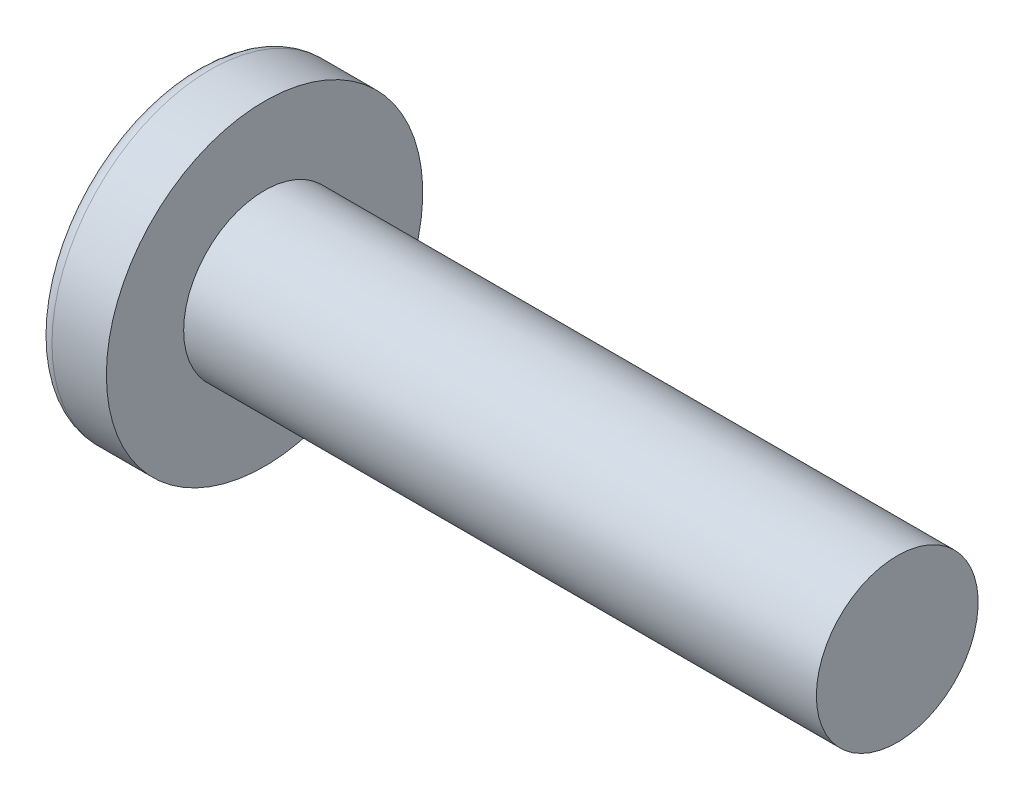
ISO-10303-21;
HEADER;
FILE_DESCRIPTION(('STEP AP214'),'2;1');
FILE_NAME('part.step','',(''),(''),'','','');
FILE_SCHEMA(('AUTOMOTIVE_DESIGN { 1 0 10303 214 1 1 1 1 }'));
ENDSEC;
DATA;
#1=APPLICATION_CONTEXT('core data for automotive mechanical design processes');
#2=APPLICATION_PROTOCOL_DEFINITION('international standard','automotive_design',2000,#1);
#3=PRODUCT_CONTEXT('',#1,'mechanical');
#4=PRODUCT('Part','Part','',(#3));
#5=PRODUCT_RELATED_PRODUCT_CATEGORY('part','',(#4));
#6=PRODUCT_DEFINITION_FORMATION('','',#4);
#7=PRODUCT_DEFINITION_CONTEXT('part definition',#1,'design');
#8=PRODUCT_DEFINITION('design','',#6,#7);
#9=PRODUCT_DEFINITION_SHAPE('','',#8);
#10=(LENGTH_UNIT() NAMED_UNIT(*) SI_UNIT(.MILLI.,.METRE.));
#11=(NAMED_UNIT(*) PLANE_ANGLE_UNIT() SI_UNIT($,.RADIAN.));
#12=(NAMED_UNIT(*) SI_UNIT($,.STERADIAN.) SOLID_ANGLE_UNIT());
#13=UNCERTAINTY_MEASURE_WITH_UNIT(LENGTH_MEASURE(1.E-05),#10,'distance_accuracy_value','');
#14=(GEOMETRIC_REPRESENTATION_CONTEXT(3) GLOBAL_UNCERTAINTY_ASSIGNED_CONTEXT((#13)) GLOBAL_UNIT_ASSIGNED_CONTEXT((#10,
#11,#12)) REPRESENTATION_CONTEXT('',''));
#15=CARTESIAN_POINT('',(0.,0.,0.));
#16=DIRECTION('',(0.,0.,1.));
#17=DIRECTION('',(1.,0.,0.));
#18=AXIS2_PLACEMENT_3D('',#15,#16,#17);
#19=CARTESIAN_POINT('',(4.55168,0.,0.));
#20=DIRECTION('',(-1.,0.,0.));
#21=DIRECTION('',(0.,1.,0.));
#22=AXIS2_PLACEMENT_3D('',#19,#20,#21);
#23=SPHERICAL_SURFACE('',#22,4.55168);
#24=CARTESIAN_POINT('',(0.870207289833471,0.,0.));
#25=DIRECTION('',(-1.,0.,0.));
#26=DIRECTION('',(0.,0.,1.));
#27=AXIS2_PLACEMENT_3D('',#24,#25,#26);
#28=CIRCLE('',#27,2.67666761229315);
#29=CARTESIAN_POINT('',(0.870207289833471,0.,2.67666761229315));
#30=VERTEX_POINT('',#29);
#31=EDGE_CURVE('E157',#30,#30,#28,.T.);
#32=ORIENTED_EDGE('',*,*,#31,.T.);
#33=EDGE_LOOP('',(#32));
#34=FACE_BOUND('',#33,.T.);
#35=CARTESIAN_POINT('',(4.54621406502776,-0.053976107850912,0.));
#36=DIRECTION('',(-0.100750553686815,-0.9949117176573,0.));
#37=DIRECTION('',(0.994911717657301,-0.100750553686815,0.));
#38=AXIS2_PLACEMENT_3D('',#35,#36,#37);
#39=CIRCLE('',#38,4.55135666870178);
#40=CARTESIAN_POINT('',(0.29828010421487,0.376194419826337,1.57634320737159));
#41=VERTEX_POINT('',#40);
#42=CARTESIAN_POINT('',(0.0357821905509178,0.402776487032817,0.402776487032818));
#43=VERTEX_POINT('',#42);
#44=EDGE_CURVE('E188',#41,#43,#39,.T.);
#45=ORIENTED_EDGE('',*,*,#44,.F.);
#46=CARTESIAN_POINT('',(3.65196023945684,0.,-1.11933639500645));
#47=DIRECTION('',(0.626498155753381,0.,0.77942290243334));
#48=DIRECTION('',(0.77942290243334,0.,-0.626498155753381));
#49=AXIS2_PLACEMENT_3D('',#46,#47,#48);
#50=CIRCLE('',#49,4.31918756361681);
#51=CARTESIAN_POINT('',(0.298280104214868,-0.376194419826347,1.57634320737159));
#52=VERTEX_POINT('',#51);
#53=EDGE_CURVE('E153',#41,#52,#50,.T.);
#54=ORIENTED_EDGE('',*,*,#53,.T.);
#55=CARTESIAN_POINT('',(4.54621406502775,0.053976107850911,0.));
#56=DIRECTION('',(-0.100750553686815,0.994911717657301,0.));
#57=DIRECTION('',(-0.994911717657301,-0.100750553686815,0.));
#58=AXIS2_PLACEMENT_3D('',#55,#56,#57);
#59=CIRCLE('',#58,4.55135666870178);
#60=CARTESIAN_POINT('',(0.0357821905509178,-0.402776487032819,0.402776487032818));
#61=VERTEX_POINT('',#60);
#62=EDGE_CURVE('E109',#61,#52,#59,.T.);
#63=ORIENTED_EDGE('',*,*,#62,.F.);
#64=CARTESIAN_POINT('',(4.54621406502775,0.,-0.0539761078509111));
#65=DIRECTION('',(-0.100750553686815,0.,-0.994911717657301));
#66=DIRECTION('',(-0.994911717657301,0.,0.100750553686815));
#67=AXIS2_PLACEMENT_3D('',#64,#65,#66);
#68=CIRCLE('',#67,4.55135666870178);
#69=CARTESIAN_POINT('',(0.298280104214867,-1.57634320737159,0.376194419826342));
#70=VERTEX_POINT('',#69);
#71=EDGE_CURVE('E134',#70,#61,#68,.T.);
#72=ORIENTED_EDGE('',*,*,#71,.F.);
#73=CARTESIAN_POINT('',(3.65196023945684,1.11933639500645,0.));
#74=DIRECTION('',(0.626498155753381,-0.77942290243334,0.));
#75=DIRECTION('',(0.77942290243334,0.626498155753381,0.));
#76=AXIS2_PLACEMENT_3D('',#73,#74,#75);
#77=CIRCLE('',#76,4.31918756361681);
#78=CARTESIAN_POINT('',(0.298280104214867,-1.57634320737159,-0.376194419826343));
#79=VERTEX_POINT('',#78);
#80=EDGE_CURVE('E142',#70,#79,#77,.T.);
#81=ORIENTED_EDGE('',*,*,#80,.T.);
#82=CARTESIAN_POINT('',(4.54621406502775,0.,0.053976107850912));
#83=DIRECTION('',(-0.100750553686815,0.,0.9949117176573));
#84=DIRECTION('',(0.994911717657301,0.,0.100750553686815));
#85=AXIS2_PLACEMENT_3D('',#82,#83,#84);
#86=CIRCLE('',#85,4.55135666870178);
#87=CARTESIAN_POINT('',(0.0357821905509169,-0.402776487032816,-0.402776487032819));
#88=VERTEX_POINT('',#87);
#89=EDGE_CURVE('E52',#88,#79,#86,.T.);
#90=ORIENTED_EDGE('',*,*,#89,.F.);
#91=CARTESIAN_POINT('',(0.298280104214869,-0.376194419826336,-1.57634320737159));
#92=VERTEX_POINT('',#91);
#93=EDGE_CURVE('E195',#92,#88,#59,.T.);
#94=ORIENTED_EDGE('',*,*,#93,.F.);
#95=CARTESIAN_POINT('',(3.65196023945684,0.,1.11933639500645));
#96=DIRECTION('',(0.626498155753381,0.,-0.77942290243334));
#97=DIRECTION('',(-0.77942290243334,0.,-0.626498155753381));
#98=AXIS2_PLACEMENT_3D('',#95,#96,#97);
#99=CIRCLE('',#98,4.31918756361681);
#100=CARTESIAN_POINT('',(0.29828010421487,0.376194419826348,-1.57634320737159));
#101=VERTEX_POINT('',#100);
#102=EDGE_CURVE('E135',#92,#101,#99,.T.);
#103=ORIENTED_EDGE('',*,*,#102,.T.);
#104=CARTESIAN_POINT('',(0.0357821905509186,0.40277648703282,-0.402776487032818));
#105=VERTEX_POINT('',#104);
#106=EDGE_CURVE('E183',#105,#101,#39,.T.);
#107=ORIENTED_EDGE('',*,*,#106,.F.);
#108=CARTESIAN_POINT('',(0.29828010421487,1.57634320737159,-0.376194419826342));
#109=VERTEX_POINT('',#108);
#110=EDGE_CURVE('E45',#109,#105,#86,.T.);
#111=ORIENTED_EDGE('',*,*,#110,.F.);
#112=CARTESIAN_POINT('',(3.65196023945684,-1.11933639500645,0.));
#113=DIRECTION('',(0.626498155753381,0.77942290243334,0.));
#114=DIRECTION('',(-0.77942290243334,0.626498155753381,0.));
#115=AXIS2_PLACEMENT_3D('',#112,#113,#114);
#116=CIRCLE('',#115,4.31918756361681);
#117=CARTESIAN_POINT('',(0.29828010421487,1.57634320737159,0.376194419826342));
#118=VERTEX_POINT('',#117);
#119=EDGE_CURVE('E11',#109,#118,#116,.T.);
#120=ORIENTED_EDGE('',*,*,#119,.T.);
#121=EDGE_CURVE('E171',#43,#118,#68,.T.);
#122=ORIENTED_EDGE('',*,*,#121,.F.);
#123=EDGE_LOOP('',(#45,#54,#63,#72,#81,#90,#94,#103,#107,#111,#120,#122));
#124=FACE_BOUND('',#123,.T.);
#125=ADVANCED_FACE('F37',(#34,#124),#23,.T.);
#126=CARTESIAN_POINT('',(2.2594,0.,-0.1776));
#127=DIRECTION('',(-0.100750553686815,0.,0.9949117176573));
#128=DIRECTION('',(0.994911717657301,0.,0.100750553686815));
#129=AXIS2_PLACEMENT_3D('',#126,#127,#128);
#130=PLANE('',#129);
#131=ORIENTED_EDGE('',*,*,#110,.T.);
#132=DIRECTION('',(0.989900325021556,-0.100243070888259,0.100243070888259));
#133=VECTOR('',#132,1.);
#134=CARTESIAN_POINT('',(2.27702336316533,0.175815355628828,-0.175815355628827));
#135=LINE('',#134,#133);
#136=CARTESIAN_POINT('',(2.0066,0.203200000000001,-0.203199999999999));
#137=VERTEX_POINT('',#136);
#138=EDGE_CURVE('E177',#105,#137,#135,.T.);
#139=ORIENTED_EDGE('',*,*,#138,.T.);
#140=DIRECTION('',(0.777006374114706,-0.624555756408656,0.0786841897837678));
#141=VECTOR('',#140,1.);
#142=CARTESIAN_POINT('',(0.,1.8161,-0.4064));
#143=LINE('',#142,#141);
#144=EDGE_CURVE('E158',#109,#137,#143,.T.);
#145=ORIENTED_EDGE('',*,*,#144,.F.);
#146=EDGE_LOOP('',(#131,#139,#145));
#147=FACE_BOUND('',#146,.T.);
#148=ADVANCED_FACE('F176',(#147),#130,.T.);
#149=DIRECTION('',(0.777006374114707,0.624555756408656,0.0786841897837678));
#150=VECTOR('',#149,1.);
#151=CARTESIAN_POINT('',(0.,-1.8161,-0.4064));
#152=LINE('',#151,#150);
#153=CARTESIAN_POINT('',(2.0066,-0.2032,-0.2032));
#154=VERTEX_POINT('',#153);
#155=EDGE_CURVE('E143',#79,#154,#152,.T.);
#156=ORIENTED_EDGE('',*,*,#155,.T.);
#157=DIRECTION('',(-0.989900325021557,-0.100243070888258,-0.100243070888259));
#158=VECTOR('',#157,1.);
#159=CARTESIAN_POINT('',(2.27702336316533,-0.175815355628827,-0.175815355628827));
#160=LINE('',#159,#158);
#161=EDGE_CURVE('E198',#154,#88,#160,.T.);
#162=ORIENTED_EDGE('',*,*,#161,.T.);
#163=ORIENTED_EDGE('',*,*,#89,.T.);
#164=EDGE_LOOP('',(#156,#162,#163));
#165=FACE_BOUND('',#164,.T.);
#166=ADVANCED_FACE('F213',(#165),#130,.T.);
#167=CARTESIAN_POINT('',(2.2594,0.,0.1776));
#168=DIRECTION('',(-0.100750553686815,0.,-0.994911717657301));
#169=DIRECTION('',(-0.994911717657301,0.,0.100750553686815));
#170=AXIS2_PLACEMENT_3D('',#167,#168,#169);
#171=PLANE('',#170);
#172=DIRECTION('',(0.777006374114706,-0.624555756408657,-0.0786841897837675));
#173=VECTOR('',#172,1.);
#174=CARTESIAN_POINT('',(0.,1.8161,0.406399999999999));
#175=LINE('',#174,#173);
#176=CARTESIAN_POINT('',(2.0066,0.2032,0.2032));
#177=VERTEX_POINT('',#176);
#178=EDGE_CURVE('E214',#118,#177,#175,.T.);
#179=ORIENTED_EDGE('',*,*,#178,.T.);
#180=DIRECTION('',(-0.989900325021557,0.100243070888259,0.100243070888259));
#181=VECTOR('',#180,1.);
#182=CARTESIAN_POINT('',(2.27702336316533,0.175815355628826,0.175815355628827));
#183=LINE('',#182,#181);
#184=EDGE_CURVE('E192',#177,#43,#183,.T.);
#185=ORIENTED_EDGE('',*,*,#184,.T.);
#186=ORIENTED_EDGE('',*,*,#121,.T.);
#187=EDGE_LOOP('',(#179,#185,#186));
#188=FACE_BOUND('',#187,.T.);
#189=ADVANCED_FACE('F218',(#188),#171,.T.);
#190=ORIENTED_EDGE('',*,*,#71,.T.);
#191=DIRECTION('',(0.989900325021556,0.100243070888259,-0.100243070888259));
#192=VECTOR('',#191,1.);
#193=CARTESIAN_POINT('',(2.27702336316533,-0.175815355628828,0.175815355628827));
#194=LINE('',#193,#192);
#195=CARTESIAN_POINT('',(2.0066,-0.203200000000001,0.203199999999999));
#196=VERTEX_POINT('',#195);
#197=EDGE_CURVE('E107',#61,#196,#194,.T.);
#198=ORIENTED_EDGE('',*,*,#197,.T.);
#199=DIRECTION('',(0.777006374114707,0.624555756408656,-0.0786841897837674));
#200=VECTOR('',#199,1.);
#201=CARTESIAN_POINT('',(0.,-1.8161,0.406399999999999));
#202=LINE('',#201,#200);
#203=EDGE_CURVE('E132',#70,#196,#202,.T.);
#204=ORIENTED_EDGE('',*,*,#203,.F.);
#205=EDGE_LOOP('',(#190,#198,#204));
#206=FACE_BOUND('',#205,.T.);
#207=ADVANCED_FACE('F131',(#206),#171,.T.);
#208=CARTESIAN_POINT('',(-25.4,0.,0.));
#209=DIRECTION('',(-1.,0.,0.));
#210=DIRECTION('',(0.,0.,1.));
#211=AXIS2_PLACEMENT_3D('',#208,#209,#210);
#212=CYLINDRICAL_SURFACE('',#211,1.4224);
#213=CARTESIAN_POINT('',(13.1572,0.,0.));
#214=DIRECTION('',(-1.,0.,0.));
#215=DIRECTION('',(0.,0.,1.));
#216=AXIS2_PLACEMENT_3D('',#213,#214,#215);
#217=CIRCLE('',#216,1.4224);
#218=CARTESIAN_POINT('',(13.1572,0.,1.4224));
#219=VERTEX_POINT('',#218);
#220=EDGE_CURVE('E154',#219,#219,#217,.T.);
#221=ORIENTED_EDGE('',*,*,#220,.T.);
#222=EDGE_LOOP('',(#221));
#223=FACE_BOUND('',#222,.T.);
#224=CARTESIAN_POINT('',(2.032,0.,0.));
#225=DIRECTION('',(-1.,0.,0.));
#226=DIRECTION('',(0.,0.,1.));
#227=AXIS2_PLACEMENT_3D('',#224,#225,#226);
#228=CIRCLE('',#227,1.4224);
#229=CARTESIAN_POINT('',(2.032,0.,1.4224));
#230=VERTEX_POINT('',#229);
#231=EDGE_CURVE('E167',#230,#230,#228,.T.);
#232=ORIENTED_EDGE('',*,*,#231,.F.);
#233=EDGE_LOOP('',(#232));
#234=FACE_BOUND('',#233,.T.);
#235=ADVANCED_FACE('F39',(#223,#234),#212,.T.);
#236=CARTESIAN_POINT('',(2.032,1.4224,0.));
#237=DIRECTION('',(-1.,0.,0.));
#238=DIRECTION('',(0.,0.,1.));
#239=AXIS2_PLACEMENT_3D('',#236,#237,#238);
#240=PLANE('',#239);
#241=CARTESIAN_POINT('',(2.032,0.,0.));
#242=DIRECTION('',(-1.,0.,0.));
#243=DIRECTION('',(0.,0.,1.));
#244=AXIS2_PLACEMENT_3D('',#241,#242,#243);
#245=CIRCLE('',#244,2.7813);
#246=CARTESIAN_POINT('',(2.032,0.,2.7813));
#247=VERTEX_POINT('',#246);
#248=EDGE_CURVE('E164',#247,#247,#245,.T.);
#249=ORIENTED_EDGE('',*,*,#248,.F.);
#250=EDGE_LOOP('',(#249));
#251=FACE_BOUND('',#250,.T.);
#252=ORIENTED_EDGE('',*,*,#231,.T.);
#253=EDGE_LOOP('',(#252));
#254=FACE_BOUND('',#253,.T.);
#255=ADVANCED_FACE('F246',(#251,#254),#240,.F.);
#256=CARTESIAN_POINT('',(-25.4,0.,0.));
#257=DIRECTION('',(-1.,0.,0.));
#258=DIRECTION('',(0.,0.,1.));
#259=AXIS2_PLACEMENT_3D('',#256,#257,#258);
#260=CYLINDRICAL_SURFACE('',#259,2.7813);
#261=ORIENTED_EDGE('',*,*,#248,.T.);
#262=EDGE_LOOP('',(#261));
#263=FACE_BOUND('',#262,.T.);
#264=CARTESIAN_POINT('',(1.07564661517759,0.,0.));
#265=DIRECTION('',(-1.,0.,0.));
#266=DIRECTION('',(0.,0.,1.));
#267=AXIS2_PLACEMENT_3D('',#264,#265,#266);
#268=CIRCLE('',#267,2.7813);
#269=CARTESIAN_POINT('',(1.07564661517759,0.,2.7813));
#270=VERTEX_POINT('',#269);
#271=EDGE_CURVE('E161',#270,#270,#268,.T.);
#272=ORIENTED_EDGE('',*,*,#271,.F.);
#273=EDGE_LOOP('',(#272));
#274=FACE_BOUND('',#273,.T.);
#275=ADVANCED_FACE('F243',(#263,#274),#260,.T.);
#276=CARTESIAN_POINT('',(1.07564661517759,0.,0.));
#277=DIRECTION('',(-1.,0.,0.));
#278=DIRECTION('',(0.,0.,1.));
#279=AXIS2_PLACEMENT_3D('',#276,#277,#278);
#280=TOROIDAL_SURFACE('',#279,2.5273,0.254);
#281=ORIENTED_EDGE('',*,*,#271,.T.);
#282=EDGE_LOOP('',(#281));
#283=FACE_BOUND('',#282,.T.);
#284=ORIENTED_EDGE('',*,*,#31,.F.);
#285=EDGE_LOOP('',(#284));
#286=FACE_BOUND('',#285,.T.);
#287=ADVANCED_FACE('F240',(#283,#286),#280,.T.);
#288=CARTESIAN_POINT('',(13.1572,1.4224,0.));
#289=DIRECTION('',(1.,0.,0.));
#290=DIRECTION('',(0.,0.,-1.));
#291=AXIS2_PLACEMENT_3D('',#288,#289,#290);
#292=PLANE('',#291);
#293=ORIENTED_EDGE('',*,*,#220,.F.);
#294=EDGE_LOOP('',(#293));
#295=FACE_BOUND('',#294,.T.);
#296=ADVANCED_FACE('F238',(#295),#292,.T.);
#297=CARTESIAN_POINT('',(2.0066,0.2032,0.2032));
#298=DIRECTION('',(0.626498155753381,0.77942290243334,0.));
#299=DIRECTION('',(-0.77942290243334,0.626498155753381,0.));
#300=AXIS2_PLACEMENT_3D('',#297,#298,#299);
#301=PLANE('',#300);
#302=ORIENTED_EDGE('',*,*,#144,.T.);
#303=DIRECTION('',(0.,0.,-1.));
#304=VECTOR('',#303,1.);
#305=CARTESIAN_POINT('',(2.0066,0.2032,0.2032));
#306=LINE('',#305,#304);
#307=EDGE_CURVE('E125',#177,#137,#306,.T.);
#308=ORIENTED_EDGE('',*,*,#307,.F.);
#309=ORIENTED_EDGE('',*,*,#178,.F.);
#310=ORIENTED_EDGE('',*,*,#119,.F.);
#311=EDGE_LOOP('',(#302,#308,#309,#310));
#312=FACE_BOUND('',#311,.T.);
#313=ADVANCED_FACE('F217',(#312),#301,.F.);
#314=CARTESIAN_POINT('',(2.0066,-0.2032,-0.2032));
#315=DIRECTION('',(0.626498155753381,-0.77942290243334,0.));
#316=DIRECTION('',(0.77942290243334,0.626498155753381,0.));
#317=AXIS2_PLACEMENT_3D('',#314,#315,#316);
#318=PLANE('',#317);
#319=ORIENTED_EDGE('',*,*,#203,.T.);
#320=DIRECTION('',(0.,0.,1.));
#321=VECTOR('',#320,1.);
#322=CARTESIAN_POINT('',(2.0066,-0.2032,-0.2032));
#323=LINE('',#322,#321);
#324=EDGE_CURVE('E124',#154,#196,#323,.T.);
#325=ORIENTED_EDGE('',*,*,#324,.F.);
#326=ORIENTED_EDGE('',*,*,#155,.F.);
#327=ORIENTED_EDGE('',*,*,#80,.F.);
#328=EDGE_LOOP('',(#319,#325,#326,#327));
#329=FACE_BOUND('',#328,.T.);
#330=ADVANCED_FACE('F139',(#329),#318,.F.);
#331=CARTESIAN_POINT('',(2.0066,0.2032,-0.2032));
#332=DIRECTION('',(-1.,0.,0.));
#333=DIRECTION('',(0.,0.,1.));
#334=AXIS2_PLACEMENT_3D('',#331,#332,#333);
#335=PLANE('',#334);
#336=DIRECTION('',(0.,1.,0.));
#337=VECTOR('',#336,1.);
#338=CARTESIAN_POINT('',(2.0066,-0.2032,-0.2032));
#339=LINE('',#338,#337);
#340=EDGE_CURVE('E147',#154,#137,#339,.T.);
#341=ORIENTED_EDGE('',*,*,#340,.F.);
#342=ORIENTED_EDGE('',*,*,#324,.T.);
#343=DIRECTION('',(0.,-1.,0.));
#344=VECTOR('',#343,1.);
#345=CARTESIAN_POINT('',(2.0066,0.2032,0.2032));
#346=LINE('',#345,#344);
#347=EDGE_CURVE('E116',#177,#196,#346,.T.);
#348=ORIENTED_EDGE('',*,*,#347,.F.);
#349=ORIENTED_EDGE('',*,*,#307,.T.);
#350=EDGE_LOOP('',(#341,#342,#348,#349));
#351=FACE_BOUND('',#350,.T.);
#352=ADVANCED_FACE('F145',(#351),#335,.T.);
#353=CARTESIAN_POINT('',(2.0066,0.203200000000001,-0.203199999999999));
#354=DIRECTION('',(0.626498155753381,0.,-0.77942290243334));
#355=DIRECTION('',(0.77942290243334,0.,0.626498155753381));
#356=AXIS2_PLACEMENT_3D('',#353,#354,#355);
#357=PLANE('',#356);
#358=DIRECTION('',(0.777006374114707,0.0786841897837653,0.624555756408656));
#359=VECTOR('',#358,1.);
#360=CARTESIAN_POINT('',(0.,-0.406399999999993,-1.8161));
#361=LINE('',#360,#359);
#362=EDGE_CURVE('E203',#92,#154,#361,.T.);
#363=ORIENTED_EDGE('',*,*,#362,.T.);
#364=ORIENTED_EDGE('',*,*,#340,.T.);
#365=DIRECTION('',(0.777006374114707,-0.0786841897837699,0.624555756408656));
#366=VECTOR('',#365,1.);
#367=CARTESIAN_POINT('',(0.,0.406400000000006,-1.8161));
#368=LINE('',#367,#366);
#369=EDGE_CURVE('E113',#101,#137,#368,.T.);
#370=ORIENTED_EDGE('',*,*,#369,.F.);
#371=ORIENTED_EDGE('',*,*,#102,.F.);
#372=EDGE_LOOP('',(#363,#364,#370,#371));
#373=FACE_BOUND('',#372,.T.);
#374=ADVANCED_FACE('F208',(#373),#357,.F.);
#375=CARTESIAN_POINT('',(2.2594,-0.1776,0.));
#376=DIRECTION('',(-0.100750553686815,0.994911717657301,0.));
#377=DIRECTION('',(-0.994911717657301,-0.100750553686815,0.));
#378=AXIS2_PLACEMENT_3D('',#375,#376,#377);
#379=PLANE('',#378);
#380=ORIENTED_EDGE('',*,*,#93,.T.);
#381=ORIENTED_EDGE('',*,*,#161,.F.);
#382=ORIENTED_EDGE('',*,*,#362,.F.);
#383=EDGE_LOOP('',(#380,#381,#382));
#384=FACE_BOUND('',#383,.T.);
#385=ADVANCED_FACE('F212',(#384),#379,.T.);
#386=CARTESIAN_POINT('',(2.2594,0.1776,0.));
#387=DIRECTION('',(-0.100750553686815,-0.9949117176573,0.));
#388=DIRECTION('',(0.994911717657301,-0.100750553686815,0.));
#389=AXIS2_PLACEMENT_3D('',#386,#387,#388);
#390=PLANE('',#389);
#391=ORIENTED_EDGE('',*,*,#106,.T.);
#392=ORIENTED_EDGE('',*,*,#369,.T.);
#393=ORIENTED_EDGE('',*,*,#138,.F.);
#394=EDGE_LOOP('',(#391,#392,#393));
#395=FACE_BOUND('',#394,.T.);
#396=ADVANCED_FACE('F206',(#395),#390,.T.);
#397=CARTESIAN_POINT('',(2.0066,-0.203200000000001,0.203199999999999));
#398=DIRECTION('',(0.626498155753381,0.,0.77942290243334));
#399=DIRECTION('',(-0.77942290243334,0.,0.626498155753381));
#400=AXIS2_PLACEMENT_3D('',#397,#398,#399);
#401=PLANE('',#400);
#402=DIRECTION('',(0.777006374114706,-0.0786841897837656,-0.624555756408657));
#403=VECTOR('',#402,1.);
#404=CARTESIAN_POINT('',(0.,0.406399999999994,1.8161));
#405=LINE('',#404,#403);
#406=EDGE_CURVE('E112',#41,#177,#405,.T.);
#407=ORIENTED_EDGE('',*,*,#406,.T.);
#408=ORIENTED_EDGE('',*,*,#347,.T.);
#409=DIRECTION('',(0.777006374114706,0.0786841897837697,-0.624555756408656));
#410=VECTOR('',#409,1.);
#411=CARTESIAN_POINT('',(0.,-0.406400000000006,1.8161));
#412=LINE('',#411,#410);
#413=EDGE_CURVE('E103',#52,#196,#412,.T.);
#414=ORIENTED_EDGE('',*,*,#413,.F.);
#415=ORIENTED_EDGE('',*,*,#53,.F.);
#416=EDGE_LOOP('',(#407,#408,#414,#415));
#417=FACE_BOUND('',#416,.T.);
#418=ADVANCED_FACE('F117',(#417),#401,.F.);
#419=ORIENTED_EDGE('',*,*,#44,.T.);
#420=ORIENTED_EDGE('',*,*,#184,.F.);
#421=ORIENTED_EDGE('',*,*,#406,.F.);
#422=EDGE_LOOP('',(#419,#420,#421));
#423=FACE_BOUND('',#422,.T.);
#424=ADVANCED_FACE('F219',(#423),#390,.T.);
#425=ORIENTED_EDGE('',*,*,#62,.T.);
#426=ORIENTED_EDGE('',*,*,#413,.T.);
#427=ORIENTED_EDGE('',*,*,#197,.F.);
#428=EDGE_LOOP('',(#425,#426,#427));
#429=FACE_BOUND('',#428,.T.);
#430=ADVANCED_FACE('F105',(#429),#379,.T.);
#431=CLOSED_SHELL('',(#125,#148,#166,#189,#207,#235,#255,#275,#287,#296,#313,#330,#352,#374,
#385,#396,#418,#424,#430));
#432=MANIFOLD_SOLID_BREP('B2',#431);
#433=ADVANCED_BREP_SHAPE_REPRESENTATION('',(#18,#432),#14);
#434=SHAPE_DEFINITION_REPRESENTATION(#9,#433);
ENDSEC;
END-ISO-10303-21;
